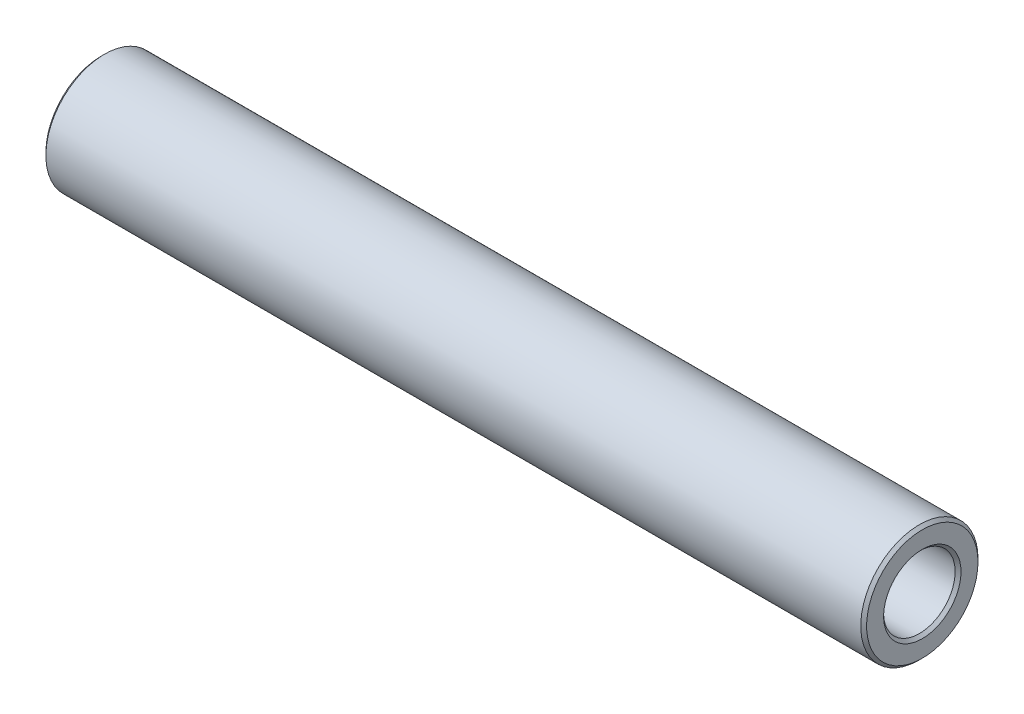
from build123d import *

# Parameters (mm, degrees)
SKETCH_1_R      = 5
SKETCH_1_R_2    = 3.05
EXTRUDE_1_DEPTH = 70
CHAMFER_1_SIZE  = 0.25


with BuildPart() as part:
    # Sketch 1 → Extrude 1 (new body)
    with BuildSketch(Plane(origin=(0, 0, 0), x_dir=(0, 0, -1), z_dir=(1, 0, 0))):
        Circle(SKETCH_1_R)
        Circle(SKETCH_1_R_2, mode=Mode.SUBTRACT)
    extrude(amount=EXTRUDE_1_DEPTH)

    # Chamfer 1
    chamfer_1_edges = [part.edges().sort_by_distance(p)[0] for p in [
        (0, 0, 5),
        (70, 0, 5),
        (0, 0, 3.05),
        (70, 0, 3.05),
    ]]
    chamfer(chamfer_1_edges, length=CHAMFER_1_SIZE)


solid = part.part
